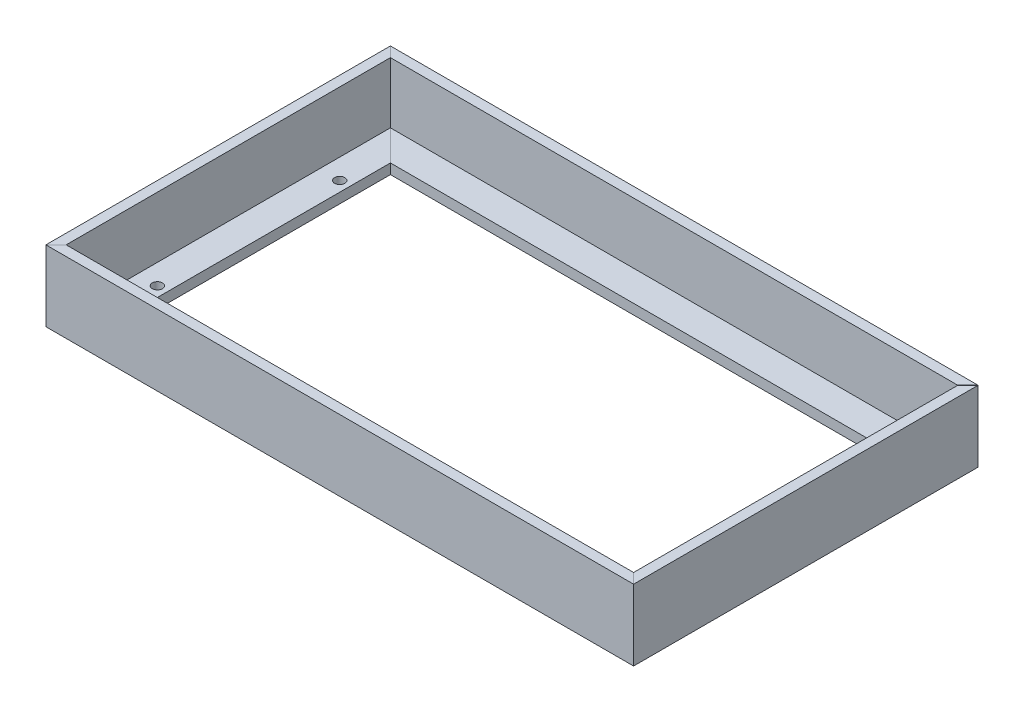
ISO-10303-21;
HEADER;
FILE_DESCRIPTION(('STEP AP214'),'2;1');
FILE_NAME('part.step','',(''),(''),'','','');
FILE_SCHEMA(('AUTOMOTIVE_DESIGN { 1 0 10303 214 1 1 1 1 }'));
ENDSEC;
DATA;
#1=APPLICATION_CONTEXT('core data for automotive mechanical design processes');
#2=APPLICATION_PROTOCOL_DEFINITION('international standard','automotive_design',2000,#1);
#3=PRODUCT_CONTEXT('',#1,'mechanical');
#4=PRODUCT('Part','Part','',(#3));
#5=PRODUCT_RELATED_PRODUCT_CATEGORY('part','',(#4));
#6=PRODUCT_DEFINITION_FORMATION('','',#4);
#7=PRODUCT_DEFINITION_CONTEXT('part definition',#1,'design');
#8=PRODUCT_DEFINITION('design','',#6,#7);
#9=PRODUCT_DEFINITION_SHAPE('','',#8);
#10=(LENGTH_UNIT() NAMED_UNIT(*) SI_UNIT(.MILLI.,.METRE.));
#11=(NAMED_UNIT(*) PLANE_ANGLE_UNIT() SI_UNIT($,.RADIAN.));
#12=(NAMED_UNIT(*) SI_UNIT($,.STERADIAN.) SOLID_ANGLE_UNIT());
#13=UNCERTAINTY_MEASURE_WITH_UNIT(LENGTH_MEASURE(1.E-05),#10,'distance_accuracy_value','');
#14=(GEOMETRIC_REPRESENTATION_CONTEXT(3) GLOBAL_UNCERTAINTY_ASSIGNED_CONTEXT((#13)) GLOBAL_UNIT_ASSIGNED_CONTEXT((#10,
#11,#12)) REPRESENTATION_CONTEXT('',''));
#15=CARTESIAN_POINT('',(0.,0.,0.));
#16=DIRECTION('',(0.,0.,1.));
#17=DIRECTION('',(1.,0.,0.));
#18=AXIS2_PLACEMENT_3D('',#15,#16,#17);
#19=CARTESIAN_POINT('',(171.45,3.17500000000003,53.975));
#20=DIRECTION('',(0.,-1.,0.));
#21=DIRECTION('',(1.,0.,0.));
#22=AXIS2_PLACEMENT_3D('',#19,#20,#21);
#23=PLANE('',#22);
#24=CARTESIAN_POINT('',(9.52500000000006,3.17500000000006,-28.575));
#25=DIRECTION('',(0.,1.,0.));
#26=DIRECTION('',(-1.,0.,0.));
#27=AXIS2_PLACEMENT_3D('',#24,#25,#26);
#28=CIRCLE('',#27,1.5875);
#29=CARTESIAN_POINT('',(7.93750000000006,3.17500000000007,-28.575));
#30=VERTEX_POINT('',#29);
#31=EDGE_CURVE('E175',#30,#30,#28,.T.);
#32=ORIENTED_EDGE('',*,*,#31,.F.);
#33=EDGE_LOOP('',(#32));
#34=FACE_BOUND('',#33,.T.);
#35=CARTESIAN_POINT('',(9.52500000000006,3.17500000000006,28.575));
#36=DIRECTION('',(0.,1.,0.));
#37=DIRECTION('',(-1.,0.,0.));
#38=AXIS2_PLACEMENT_3D('',#35,#36,#37);
#39=CIRCLE('',#38,1.58749999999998);
#40=CARTESIAN_POINT('',(7.93750000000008,3.17500000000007,28.575));
#41=VERTEX_POINT('',#40);
#42=EDGE_CURVE('E145',#41,#41,#39,.T.);
#43=ORIENTED_EDGE('',*,*,#42,.F.);
#44=EDGE_LOOP('',(#43));
#45=FACE_BOUND('',#44,.T.);
#46=DIRECTION('',(0.,0.,-1.));
#47=VECTOR('',#46,1.);
#48=CARTESIAN_POINT('',(3.175,3.175,53.975));
#49=LINE('',#48,#47);
#50=CARTESIAN_POINT('',(3.175,3.175,50.7640789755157));
#51=VERTEX_POINT('',#50);
#52=CARTESIAN_POINT('',(3.17500000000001,3.17500000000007,-50.7640789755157));
#53=VERTEX_POINT('',#52);
#54=EDGE_CURVE('E130',#51,#53,#49,.T.);
#55=ORIENTED_EDGE('',*,*,#54,.F.);
#56=DIRECTION('',(0.707106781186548,0.,-0.707106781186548));
#57=VECTOR('',#56,1.);
#58=CARTESIAN_POINT('',(85.7070394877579,3.17500000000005,-31.7679605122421));
#59=LINE('',#58,#57);
#60=CARTESIAN_POINT('',(12.7,3.17500000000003,41.2390789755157));
#61=VERTEX_POINT('',#60);
#62=EDGE_CURVE('E124',#51,#61,#59,.T.);
#63=ORIENTED_EDGE('',*,*,#62,.T.);
#64=DIRECTION('',(0.,0.,-1.));
#65=VECTOR('',#64,1.);
#66=CARTESIAN_POINT('',(12.7,3.175,53.975));
#67=LINE('',#66,#65);
#68=CARTESIAN_POINT('',(12.7,3.17500000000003,-41.2390789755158));
#69=VERTEX_POINT('',#68);
#70=EDGE_CURVE('E126',#61,#69,#67,.T.);
#71=ORIENTED_EDGE('',*,*,#70,.T.);
#72=DIRECTION('',(-0.707106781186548,0.,-0.707106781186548));
#73=VECTOR('',#72,1.);
#74=CARTESIAN_POINT('',(139.682039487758,3.17500000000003,85.7429605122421));
#75=LINE('',#74,#73);
#76=EDGE_CURVE('E118',#69,#53,#75,.T.);
#77=ORIENTED_EDGE('',*,*,#76,.T.);
#78=EDGE_LOOP('',(#55,#63,#71,#77));
#79=FACE_BOUND('',#78,.T.);
#80=ADVANCED_FACE('F43',(#34,#45,#79),#23,.F.);
#81=CARTESIAN_POINT('',(0.,0.,53.975));
#82=DIRECTION('',(0.,1.,0.));
#83=DIRECTION('',(0.,0.,1.));
#84=AXIS2_PLACEMENT_3D('',#81,#82,#83);
#85=PLANE('',#84);
#86=CARTESIAN_POINT('',(9.52500000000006,0.,-28.575));
#87=DIRECTION('',(0.,1.,0.));
#88=DIRECTION('',(-1.,0.,0.));
#89=AXIS2_PLACEMENT_3D('',#86,#87,#88);
#90=CIRCLE('',#89,1.5875);
#91=CARTESIAN_POINT('',(7.93750000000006,0.,-28.575));
#92=VERTEX_POINT('',#91);
#93=EDGE_CURVE('E127',#92,#92,#90,.T.);
#94=ORIENTED_EDGE('',*,*,#93,.T.);
#95=EDGE_LOOP('',(#94));
#96=FACE_BOUND('',#95,.T.);
#97=CARTESIAN_POINT('',(9.52500000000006,0.,28.575));
#98=DIRECTION('',(0.,1.,0.));
#99=DIRECTION('',(-1.,0.,0.));
#100=AXIS2_PLACEMENT_3D('',#97,#98,#99);
#101=CIRCLE('',#100,1.58749999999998);
#102=CARTESIAN_POINT('',(7.93750000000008,0.,28.575));
#103=VERTEX_POINT('',#102);
#104=EDGE_CURVE('E240',#103,#103,#101,.T.);
#105=ORIENTED_EDGE('',*,*,#104,.T.);
#106=EDGE_LOOP('',(#105));
#107=FACE_BOUND('',#106,.T.);
#108=DIRECTION('',(0.,0.,-1.));
#109=VECTOR('',#108,1.);
#110=CARTESIAN_POINT('',(12.7,0.,53.975));
#111=LINE('',#110,#109);
#112=CARTESIAN_POINT('',(12.7,0.,41.2390789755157));
#113=VERTEX_POINT('',#112);
#114=CARTESIAN_POINT('',(12.7,0.,-41.2390789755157));
#115=VERTEX_POINT('',#114);
#116=EDGE_CURVE('E123',#113,#115,#111,.T.);
#117=ORIENTED_EDGE('',*,*,#116,.F.);
#118=DIRECTION('',(-0.707106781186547,0.,0.707106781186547));
#119=VECTOR('',#118,1.);
#120=CARTESIAN_POINT('',(-0.0179605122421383,0.,53.9570394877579));
#121=LINE('',#120,#119);
#122=CARTESIAN_POINT('',(0.,0.,53.9390789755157));
#123=VERTEX_POINT('',#122);
#124=EDGE_CURVE('E46',#113,#123,#121,.T.);
#125=ORIENTED_EDGE('',*,*,#124,.T.);
#126=DIRECTION('',(0.,0.,-1.));
#127=VECTOR('',#126,1.);
#128=CARTESIAN_POINT('',(0.,0.,53.975));
#129=LINE('',#128,#127);
#130=CARTESIAN_POINT('',(0.,0.,-53.9390789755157));
#131=VERTEX_POINT('',#130);
#132=EDGE_CURVE('E121',#123,#131,#129,.T.);
#133=ORIENTED_EDGE('',*,*,#132,.T.);
#134=DIRECTION('',(0.707106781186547,0.,0.707106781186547));
#135=VECTOR('',#134,1.);
#136=CARTESIAN_POINT('',(-0.0179605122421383,0.,-53.9570394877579));
#137=LINE('',#136,#135);
#138=EDGE_CURVE('E110',#131,#115,#137,.T.);
#139=ORIENTED_EDGE('',*,*,#138,.T.);
#140=EDGE_LOOP('',(#117,#125,#133,#139));
#141=FACE_BOUND('',#140,.T.);
#142=ADVANCED_FACE('F154',(#96,#107,#141),#85,.F.);
#143=CARTESIAN_POINT('',(3.175,22.225,53.975));
#144=DIRECTION('',(0.,-1.,0.));
#145=DIRECTION('',(0.,0.,-1.));
#146=AXIS2_PLACEMENT_3D('',#143,#144,#145);
#147=PLANE('',#146);
#148=DIRECTION('',(0.,0.,-1.));
#149=VECTOR('',#148,1.);
#150=CARTESIAN_POINT('',(0.,22.225,53.975));
#151=LINE('',#150,#149);
#152=CARTESIAN_POINT('',(0.,22.225,53.9390789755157));
#153=VERTEX_POINT('',#152);
#154=CARTESIAN_POINT('',(0.,22.225,-53.9390789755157));
#155=VERTEX_POINT('',#154);
#156=EDGE_CURVE('E94',#153,#155,#151,.T.);
#157=ORIENTED_EDGE('',*,*,#156,.F.);
#158=DIRECTION('',(-0.707106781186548,0.,0.707106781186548));
#159=VECTOR('',#158,1.);
#160=CARTESIAN_POINT('',(12.6820394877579,22.225,41.2570394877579));
#161=LINE('',#160,#159);
#162=CARTESIAN_POINT('',(3.175,22.225,50.7640789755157));
#163=VERTEX_POINT('',#162);
#164=EDGE_CURVE('E12',#163,#153,#161,.T.);
#165=ORIENTED_EDGE('',*,*,#164,.F.);
#166=DIRECTION('',(0.,0.,-1.));
#167=VECTOR('',#166,1.);
#168=CARTESIAN_POINT('',(3.175,22.225,53.975));
#169=LINE('',#168,#167);
#170=CARTESIAN_POINT('',(3.17500000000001,22.225,-50.7640789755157));
#171=VERTEX_POINT('',#170);
#172=EDGE_CURVE('E114',#163,#171,#169,.T.);
#173=ORIENTED_EDGE('',*,*,#172,.T.);
#174=DIRECTION('',(0.707106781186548,0.,0.707106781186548));
#175=VECTOR('',#174,1.);
#176=CARTESIAN_POINT('',(12.6820394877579,22.225,-41.2570394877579));
#177=LINE('',#176,#175);
#178=EDGE_CURVE('E52',#155,#171,#177,.T.);
#179=ORIENTED_EDGE('',*,*,#178,.F.);
#180=EDGE_LOOP('',(#157,#165,#173,#179));
#181=FACE_BOUND('',#180,.T.);
#182=ADVANCED_FACE('F112',(#181),#147,.F.);
#183=CARTESIAN_POINT('',(12.7,0.,53.975));
#184=DIRECTION('',(-1.,0.,0.));
#185=DIRECTION('',(0.,0.,1.));
#186=AXIS2_PLACEMENT_3D('',#183,#184,#185);
#187=PLANE('',#186);
#188=ORIENTED_EDGE('',*,*,#70,.F.);
#189=DIRECTION('',(0.,-1.,0.));
#190=VECTOR('',#189,1.);
#191=CARTESIAN_POINT('',(12.7,0.,41.2390789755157));
#192=LINE('',#191,#190);
#193=EDGE_CURVE('E59',#61,#113,#192,.T.);
#194=ORIENTED_EDGE('',*,*,#193,.T.);
#195=ORIENTED_EDGE('',*,*,#116,.T.);
#196=DIRECTION('',(0.,1.,0.));
#197=VECTOR('',#196,1.);
#198=CARTESIAN_POINT('',(12.7,0.,-41.2390789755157));
#199=LINE('',#198,#197);
#200=EDGE_CURVE('E131',#115,#69,#199,.T.);
#201=ORIENTED_EDGE('',*,*,#200,.T.);
#202=EDGE_LOOP('',(#188,#194,#195,#201));
#203=FACE_BOUND('',#202,.T.);
#204=ADVANCED_FACE('F155',(#203),#187,.F.);
#205=CARTESIAN_POINT('',(3.175,3.175,53.975));
#206=DIRECTION('',(-1.,0.,0.));
#207=DIRECTION('',(0.,-1.,0.));
#208=AXIS2_PLACEMENT_3D('',#205,#206,#207);
#209=PLANE('',#208);
#210=ORIENTED_EDGE('',*,*,#172,.F.);
#211=DIRECTION('',(0.,-1.,0.));
#212=VECTOR('',#211,1.);
#213=CARTESIAN_POINT('',(3.175,3.175,50.7640789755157));
#214=LINE('',#213,#212);
#215=EDGE_CURVE('E128',#163,#51,#214,.T.);
#216=ORIENTED_EDGE('',*,*,#215,.T.);
#217=ORIENTED_EDGE('',*,*,#54,.T.);
#218=DIRECTION('',(0.,1.,0.));
#219=VECTOR('',#218,1.);
#220=CARTESIAN_POINT('',(3.175,3.17499999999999,-50.7640789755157));
#221=LINE('',#220,#219);
#222=EDGE_CURVE('E134',#53,#171,#221,.T.);
#223=ORIENTED_EDGE('',*,*,#222,.T.);
#224=EDGE_LOOP('',(#210,#216,#217,#223));
#225=FACE_BOUND('',#224,.T.);
#226=ADVANCED_FACE('F157',(#225),#209,.F.);
#227=CARTESIAN_POINT('',(0.,0.,53.975));
#228=DIRECTION('',(1.,0.,0.));
#229=DIRECTION('',(0.,0.,-1.));
#230=AXIS2_PLACEMENT_3D('',#227,#228,#229);
#231=PLANE('',#230);
#232=ORIENTED_EDGE('',*,*,#132,.F.);
#233=DIRECTION('',(0.,1.,0.));
#234=VECTOR('',#233,1.);
#235=CARTESIAN_POINT('',(0.,0.,53.9390789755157));
#236=LINE('',#235,#234);
#237=EDGE_CURVE('E74',#123,#153,#236,.T.);
#238=ORIENTED_EDGE('',*,*,#237,.T.);
#239=ORIENTED_EDGE('',*,*,#156,.T.);
#240=DIRECTION('',(0.,-1.,0.));
#241=VECTOR('',#240,1.);
#242=CARTESIAN_POINT('',(0.,0.,-53.9390789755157));
#243=LINE('',#242,#241);
#244=EDGE_CURVE('E98',#155,#131,#243,.T.);
#245=ORIENTED_EDGE('',*,*,#244,.T.);
#246=EDGE_LOOP('',(#232,#238,#239,#245));
#247=FACE_BOUND('',#246,.T.);
#248=ADVANCED_FACE('F97',(#247),#231,.F.);
#249=CARTESIAN_POINT('',(12.6820394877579,0.,-41.2570394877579));
#250=DIRECTION('',(-0.707106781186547,0.,0.707106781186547));
#251=DIRECTION('',(0.707106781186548,0.,0.707106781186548));
#252=AXIS2_PLACEMENT_3D('',#249,#250,#251);
#253=PLANE('',#252);
#254=ORIENTED_EDGE('',*,*,#138,.F.);
#255=ORIENTED_EDGE('',*,*,#244,.F.);
#256=ORIENTED_EDGE('',*,*,#178,.T.);
#257=ORIENTED_EDGE('',*,*,#222,.F.);
#258=ORIENTED_EDGE('',*,*,#76,.F.);
#259=ORIENTED_EDGE('',*,*,#200,.F.);
#260=EDGE_LOOP('',(#254,#255,#256,#257,#258,#259));
#261=FACE_BOUND('',#260,.T.);
#262=ADVANCED_FACE('F105',(#261),#253,.F.);
#263=CARTESIAN_POINT('',(12.6820394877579,0.,41.2570394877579));
#264=DIRECTION('',(-0.707106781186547,0.,-0.707106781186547));
#265=DIRECTION('',(-0.707106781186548,0.,0.707106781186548));
#266=AXIS2_PLACEMENT_3D('',#263,#264,#265);
#267=PLANE('',#266);
#268=ORIENTED_EDGE('',*,*,#62,.F.);
#269=ORIENTED_EDGE('',*,*,#215,.F.);
#270=ORIENTED_EDGE('',*,*,#164,.T.);
#271=ORIENTED_EDGE('',*,*,#237,.F.);
#272=ORIENTED_EDGE('',*,*,#124,.F.);
#273=ORIENTED_EDGE('',*,*,#193,.F.);
#274=EDGE_LOOP('',(#268,#269,#270,#271,#272,#273));
#275=FACE_BOUND('',#274,.T.);
#276=ADVANCED_FACE('F178',(#275),#267,.F.);
#277=CARTESIAN_POINT('',(9.52500000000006,0.,28.575));
#278=DIRECTION('',(0.,1.,0.));
#279=DIRECTION('',(-1.,0.,0.));
#280=AXIS2_PLACEMENT_3D('',#277,#278,#279);
#281=CYLINDRICAL_SURFACE('',#280,1.58749999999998);
#282=ORIENTED_EDGE('',*,*,#104,.F.);
#283=EDGE_LOOP('',(#282));
#284=FACE_BOUND('',#283,.T.);
#285=ORIENTED_EDGE('',*,*,#42,.T.);
#286=EDGE_LOOP('',(#285));
#287=FACE_BOUND('',#286,.T.);
#288=ADVANCED_FACE('F180',(#284,#287),#281,.F.);
#289=CARTESIAN_POINT('',(9.52500000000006,0.,-28.575));
#290=DIRECTION('',(0.,1.,0.));
#291=DIRECTION('',(-1.,0.,0.));
#292=AXIS2_PLACEMENT_3D('',#289,#290,#291);
#293=CYLINDRICAL_SURFACE('',#292,1.5875);
#294=ORIENTED_EDGE('',*,*,#93,.F.);
#295=EDGE_LOOP('',(#294));
#296=FACE_BOUND('',#295,.T.);
#297=ORIENTED_EDGE('',*,*,#31,.T.);
#298=EDGE_LOOP('',(#297));
#299=FACE_BOUND('',#298,.T.);
#300=ADVANCED_FACE('F186',(#296,#299),#293,.F.);
#301=CLOSED_SHELL('',(#80,#142,#182,#204,#226,#248,#262,#276,#288,#300));
#302=MANIFOLD_SOLID_BREP('B2',#301);
#303=CARTESIAN_POINT('',(184.132039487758,0.,53.9929605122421));
#304=DIRECTION('',(-0.707106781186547,0.,0.707106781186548));
#305=DIRECTION('',(0.707106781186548,0.,0.707106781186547));
#306=AXIS2_PLACEMENT_3D('',#303,#304,#305);
#307=PLANE('',#306);
#308=DIRECTION('',(0.,-1.,0.));
#309=VECTOR('',#308,1.);
#310=CARTESIAN_POINT('',(184.114078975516,0.,53.975));
#311=LINE('',#310,#309);
#312=CARTESIAN_POINT('',(184.114078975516,22.225,53.975));
#313=VERTEX_POINT('',#312);
#314=CARTESIAN_POINT('',(184.114078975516,0.,53.975));
#315=VERTEX_POINT('',#314);
#316=EDGE_CURVE('E369',#313,#315,#311,.T.);
#317=ORIENTED_EDGE('',*,*,#316,.T.);
#318=DIRECTION('',(0.707106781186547,0.,0.707106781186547));
#319=VECTOR('',#318,1.);
#320=CARTESIAN_POINT('',(171.432039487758,0.,41.2929605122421));
#321=LINE('',#320,#319);
#322=CARTESIAN_POINT('',(171.414078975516,0.,41.275));
#323=VERTEX_POINT('',#322);
#324=EDGE_CURVE('E364',#323,#315,#321,.T.);
#325=ORIENTED_EDGE('',*,*,#324,.F.);
#326=DIRECTION('',(0.,1.,0.));
#327=VECTOR('',#326,1.);
#328=CARTESIAN_POINT('',(171.414078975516,0.,41.275));
#329=LINE('',#328,#327);
#330=CARTESIAN_POINT('',(171.414078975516,3.17500000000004,41.275));
#331=VERTEX_POINT('',#330);
#332=EDGE_CURVE('E362',#323,#331,#329,.T.);
#333=ORIENTED_EDGE('',*,*,#332,.T.);
#334=DIRECTION('',(-0.707106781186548,0.,-0.707106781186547));
#335=VECTOR('',#334,1.);
#336=CARTESIAN_POINT('',(177.782039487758,3.17500000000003,47.6429605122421));
#337=LINE('',#336,#335);
#338=CARTESIAN_POINT('',(180.939078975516,3.17500000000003,50.8));
#339=VERTEX_POINT('',#338);
#340=EDGE_CURVE('E359',#339,#331,#337,.T.);
#341=ORIENTED_EDGE('',*,*,#340,.F.);
#342=DIRECTION('',(0.,-1.,0.));
#343=VECTOR('',#342,1.);
#344=CARTESIAN_POINT('',(180.939078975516,0.,50.8));
#345=LINE('',#344,#343);
#346=CARTESIAN_POINT('',(180.939078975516,22.225,50.8));
#347=VERTEX_POINT('',#346);
#348=EDGE_CURVE('E387',#347,#339,#345,.T.);
#349=ORIENTED_EDGE('',*,*,#348,.F.);
#350=DIRECTION('',(0.707106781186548,0.,0.707106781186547));
#351=VECTOR('',#350,1.);
#352=CARTESIAN_POINT('',(184.132039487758,22.225,53.9929605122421));
#353=LINE('',#352,#351);
#354=EDGE_CURVE('E317',#347,#313,#353,.T.);
#355=ORIENTED_EDGE('',*,*,#354,.T.);
#356=EDGE_LOOP('',(#317,#325,#333,#341,#349,#355));
#357=FACE_BOUND('',#356,.T.);
#358=ADVANCED_FACE('F309',(#357),#307,.F.);
#359=CARTESIAN_POINT('',(12.7,0.,41.275));
#360=DIRECTION('',(0.,0.,-1.));
#361=DIRECTION('',(-1.,0.,0.));
#362=AXIS2_PLACEMENT_3D('',#359,#360,#361);
#363=PLANE('',#362);
#364=DIRECTION('',(0.,-1.,0.));
#365=VECTOR('',#364,1.);
#366=CARTESIAN_POINT('',(12.7359210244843,0.,41.275));
#367=LINE('',#366,#365);
#368=CARTESIAN_POINT('',(12.7359210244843,3.175,41.275));
#369=VERTEX_POINT('',#368);
#370=CARTESIAN_POINT('',(12.7359210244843,0.,41.275));
#371=VERTEX_POINT('',#370);
#372=EDGE_CURVE('E41',#369,#371,#367,.T.);
#373=ORIENTED_EDGE('',*,*,#372,.F.);
#374=DIRECTION('',(-1.,0.,0.));
#375=VECTOR('',#374,1.);
#376=CARTESIAN_POINT('',(12.7,3.175,41.275));
#377=LINE('',#376,#375);
#378=EDGE_CURVE('E374',#331,#369,#377,.T.);
#379=ORIENTED_EDGE('',*,*,#378,.F.);
#380=ORIENTED_EDGE('',*,*,#332,.F.);
#381=DIRECTION('',(-1.,0.,0.));
#382=VECTOR('',#381,1.);
#383=CARTESIAN_POINT('',(12.7,0.,41.275));
#384=LINE('',#383,#382);
#385=EDGE_CURVE('E384',#323,#371,#384,.T.);
#386=ORIENTED_EDGE('',*,*,#385,.T.);
#387=EDGE_LOOP('',(#373,#379,#380,#386));
#388=FACE_BOUND('',#387,.T.);
#389=ADVANCED_FACE('F379',(#388),#363,.T.);
#390=CARTESIAN_POINT('',(0.,0.,53.975));
#391=DIRECTION('',(0.,0.,1.));
#392=DIRECTION('',(1.,0.,0.));
#393=AXIS2_PLACEMENT_3D('',#390,#391,#392);
#394=PLANE('',#393);
#395=DIRECTION('',(0.,1.,0.));
#396=VECTOR('',#395,1.);
#397=CARTESIAN_POINT('',(0.0359210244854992,0.,53.975));
#398=LINE('',#397,#396);
#399=CARTESIAN_POINT('',(0.0359210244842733,0.,53.975));
#400=VERTEX_POINT('',#399);
#401=CARTESIAN_POINT('',(0.0359210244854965,22.225,53.975));
#402=VERTEX_POINT('',#401);
#403=EDGE_CURVE('E377',#400,#402,#398,.T.);
#404=ORIENTED_EDGE('',*,*,#403,.F.);
#405=DIRECTION('',(1.,0.,0.));
#406=VECTOR('',#405,1.);
#407=CARTESIAN_POINT('',(0.,0.,53.975));
#408=LINE('',#407,#406);
#409=EDGE_CURVE('E345',#400,#315,#408,.T.);
#410=ORIENTED_EDGE('',*,*,#409,.T.);
#411=ORIENTED_EDGE('',*,*,#316,.F.);
#412=DIRECTION('',(-1.,0.,0.));
#413=VECTOR('',#412,1.);
#414=CARTESIAN_POINT('',(3.175,22.225,53.975));
#415=LINE('',#414,#413);
#416=EDGE_CURVE('E389',#313,#402,#415,.T.);
#417=ORIENTED_EDGE('',*,*,#416,.T.);
#418=EDGE_LOOP('',(#404,#410,#411,#417));
#419=FACE_BOUND('',#418,.T.);
#420=ADVANCED_FACE('F403',(#419),#394,.T.);
#421=CARTESIAN_POINT('',(0.,0.,50.8));
#422=DIRECTION('',(0.,0.,1.));
#423=DIRECTION('',(1.,0.,0.));
#424=AXIS2_PLACEMENT_3D('',#421,#422,#423);
#425=PLANE('',#424);
#426=DIRECTION('',(-1.,0.,0.));
#427=VECTOR('',#426,1.);
#428=CARTESIAN_POINT('',(12.7,3.175,50.8));
#429=LINE('',#428,#427);
#430=CARTESIAN_POINT('',(3.21092102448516,3.17500000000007,50.8));
#431=VERTEX_POINT('',#430);
#432=EDGE_CURVE('E376',#339,#431,#429,.T.);
#433=ORIENTED_EDGE('',*,*,#432,.T.);
#434=DIRECTION('',(0.,1.,0.));
#435=VECTOR('',#434,1.);
#436=CARTESIAN_POINT('',(3.21092102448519,0.,50.8));
#437=LINE('',#436,#435);
#438=CARTESIAN_POINT('',(3.21092102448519,22.225,50.8));
#439=VERTEX_POINT('',#438);
#440=EDGE_CURVE('E352',#431,#439,#437,.T.);
#441=ORIENTED_EDGE('',*,*,#440,.T.);
#442=DIRECTION('',(-1.,0.,0.));
#443=VECTOR('',#442,1.);
#444=CARTESIAN_POINT('',(0.,22.225,50.8));
#445=LINE('',#444,#443);
#446=EDGE_CURVE('E381',#347,#439,#445,.T.);
#447=ORIENTED_EDGE('',*,*,#446,.F.);
#448=ORIENTED_EDGE('',*,*,#348,.T.);
#449=EDGE_LOOP('',(#433,#441,#447,#448));
#450=FACE_BOUND('',#449,.T.);
#451=ADVANCED_FACE('F397',(#450),#425,.F.);
#452=CARTESIAN_POINT('',(3.175,22.225,53.975));
#453=DIRECTION('',(0.,-1.,0.));
#454=DIRECTION('',(0.,0.,-1.));
#455=AXIS2_PLACEMENT_3D('',#452,#453,#454);
#456=PLANE('',#455);
#457=ORIENTED_EDGE('',*,*,#446,.T.);
#458=DIRECTION('',(0.707106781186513,0.,-0.707106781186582));
#459=VECTOR('',#458,1.);
#460=CARTESIAN_POINT('',(12.7179605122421,22.225,41.2929605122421));
#461=LINE('',#460,#459);
#462=EDGE_CURVE('E402',#402,#439,#461,.T.);
#463=ORIENTED_EDGE('',*,*,#462,.F.);
#464=ORIENTED_EDGE('',*,*,#416,.F.);
#465=ORIENTED_EDGE('',*,*,#354,.F.);
#466=EDGE_LOOP('',(#457,#463,#464,#465));
#467=FACE_BOUND('',#466,.T.);
#468=ADVANCED_FACE('F400',(#467),#456,.F.);
#469=CARTESIAN_POINT('',(0.,0.,53.975));
#470=DIRECTION('',(0.,1.,0.));
#471=DIRECTION('',(0.,0.,1.));
#472=AXIS2_PLACEMENT_3D('',#469,#470,#471);
#473=PLANE('',#472);
#474=ORIENTED_EDGE('',*,*,#409,.F.);
#475=DIRECTION('',(0.707106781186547,0.,-0.707106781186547));
#476=VECTOR('',#475,1.);
#477=CARTESIAN_POINT('',(0.0179605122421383,0.,53.9929605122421));
#478=LINE('',#477,#476);
#479=EDGE_CURVE('E411',#400,#371,#478,.T.);
#480=ORIENTED_EDGE('',*,*,#479,.T.);
#481=ORIENTED_EDGE('',*,*,#385,.F.);
#482=ORIENTED_EDGE('',*,*,#324,.T.);
#483=EDGE_LOOP('',(#474,#480,#481,#482));
#484=FACE_BOUND('',#483,.T.);
#485=ADVANCED_FACE('F419',(#484),#473,.F.);
#486=CARTESIAN_POINT('',(171.45,3.17500000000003,53.975));
#487=DIRECTION('',(0.,-1.,0.));
#488=DIRECTION('',(1.,0.,0.));
#489=AXIS2_PLACEMENT_3D('',#486,#487,#488);
#490=PLANE('',#489);
#491=ORIENTED_EDGE('',*,*,#378,.T.);
#492=DIRECTION('',(-0.707106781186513,0.,0.707106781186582));
#493=VECTOR('',#492,1.);
#494=CARTESIAN_POINT('',(85.7429605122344,3.17500000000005,-31.7320394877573));
#495=LINE('',#494,#493);
#496=EDGE_CURVE('E323',#369,#431,#495,.T.);
#497=ORIENTED_EDGE('',*,*,#496,.T.);
#498=ORIENTED_EDGE('',*,*,#432,.F.);
#499=ORIENTED_EDGE('',*,*,#340,.T.);
#500=EDGE_LOOP('',(#491,#497,#498,#499));
#501=FACE_BOUND('',#500,.T.);
#502=ADVANCED_FACE('F311',(#501),#490,.F.);
#503=CARTESIAN_POINT('',(12.7179605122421,0.,41.2929605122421));
#504=DIRECTION('',(0.707106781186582,0.,0.707106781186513));
#505=DIRECTION('',(0.707106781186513,0.,-0.707106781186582));
#506=AXIS2_PLACEMENT_3D('',#503,#504,#505);
#507=PLANE('',#506);
#508=ORIENTED_EDGE('',*,*,#403,.T.);
#509=ORIENTED_EDGE('',*,*,#462,.T.);
#510=ORIENTED_EDGE('',*,*,#440,.F.);
#511=ORIENTED_EDGE('',*,*,#496,.F.);
#512=ORIENTED_EDGE('',*,*,#372,.T.);
#513=ORIENTED_EDGE('',*,*,#479,.F.);
#514=EDGE_LOOP('',(#508,#509,#510,#511,#512,#513));
#515=FACE_BOUND('',#514,.T.);
#516=ADVANCED_FACE('F412',(#515),#507,.F.);
#517=CLOSED_SHELL('',(#358,#389,#420,#451,#468,#485,#502,#516));
#518=MANIFOLD_SOLID_BREP('B6',#517);
#519=CARTESIAN_POINT('',(171.467960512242,0.,-41.2570394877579));
#520=DIRECTION('',(0.707106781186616,0.,0.707106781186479));
#521=DIRECTION('',(0.707106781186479,0.,-0.707106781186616));
#522=AXIS2_PLACEMENT_3D('',#519,#520,#521);
#523=PLANE('',#522);
#524=DIRECTION('',(0.707106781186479,0.,-0.707106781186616));
#525=VECTOR('',#524,1.);
#526=CARTESIAN_POINT('',(171.467960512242,22.225,-41.2570394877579));
#527=LINE('',#526,#525);
#528=CARTESIAN_POINT('',(180.975,22.225,-50.7640789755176));
#529=VERTEX_POINT('',#528);
#530=CARTESIAN_POINT('',(184.15,22.225,-53.9390789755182));
#531=VERTEX_POINT('',#530);
#532=EDGE_CURVE('E607',#529,#531,#527,.T.);
#533=ORIENTED_EDGE('',*,*,#532,.T.);
#534=DIRECTION('',(0.,-1.,0.));
#535=VECTOR('',#534,1.);
#536=CARTESIAN_POINT('',(184.15,22.225,-53.9390789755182));
#537=LINE('',#536,#535);
#538=CARTESIAN_POINT('',(184.15,0.,-53.9390789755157));
#539=VERTEX_POINT('',#538);
#540=EDGE_CURVE('E543',#531,#539,#537,.T.);
#541=ORIENTED_EDGE('',*,*,#540,.T.);
#542=DIRECTION('',(0.707106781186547,0.,-0.707106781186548));
#543=VECTOR('',#542,1.);
#544=CARTESIAN_POINT('',(184.167960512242,0.,-53.9570394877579));
#545=LINE('',#544,#543);
#546=CARTESIAN_POINT('',(171.45,0.,-41.2390789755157));
#547=VERTEX_POINT('',#546);
#548=EDGE_CURVE('E595',#547,#539,#545,.T.);
#549=ORIENTED_EDGE('',*,*,#548,.F.);
#550=DIRECTION('',(0.,-1.,0.));
#551=VECTOR('',#550,1.);
#552=CARTESIAN_POINT('',(171.45,0.,-41.2390789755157));
#553=LINE('',#552,#551);
#554=CARTESIAN_POINT('',(171.45,3.17500000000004,-41.2390789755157));
#555=VERTEX_POINT('',#554);
#556=EDGE_CURVE('E583',#555,#547,#553,.T.);
#557=ORIENTED_EDGE('',*,*,#556,.F.);
#558=DIRECTION('',(-0.707106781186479,0.,0.707106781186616));
#559=VECTOR('',#558,1.);
#560=CARTESIAN_POINT('',(123.842960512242,3.17500000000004,6.36796051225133));
#561=LINE('',#560,#559);
#562=CARTESIAN_POINT('',(180.975,3.17500000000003,-50.7640789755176));
#563=VERTEX_POINT('',#562);
#564=EDGE_CURVE('E594',#563,#555,#561,.T.);
#565=ORIENTED_EDGE('',*,*,#564,.F.);
#566=DIRECTION('',(0.,-1.,0.));
#567=VECTOR('',#566,1.);
#568=CARTESIAN_POINT('',(180.975,3.17500000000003,-50.7640789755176));
#569=LINE('',#568,#567);
#570=EDGE_CURVE('E589',#529,#563,#569,.T.);
#571=ORIENTED_EDGE('',*,*,#570,.F.);
#572=EDGE_LOOP('',(#533,#541,#549,#557,#565,#571));
#573=FACE_BOUND('',#572,.T.);
#574=ADVANCED_FACE('F535',(#573),#523,.F.);
#575=CARTESIAN_POINT('',(171.45,0.,53.975));
#576=DIRECTION('',(1.,0.,0.));
#577=DIRECTION('',(0.,0.,-1.));
#578=AXIS2_PLACEMENT_3D('',#575,#576,#577);
#579=PLANE('',#578);
#580=DIRECTION('',(0.,0.,-1.));
#581=VECTOR('',#580,1.);
#582=CARTESIAN_POINT('',(171.45,0.,53.975));
#583=LINE('',#582,#581);
#584=CARTESIAN_POINT('',(171.45,0.,41.2390789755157));
#585=VERTEX_POINT('',#584);
#586=EDGE_CURVE('E573',#585,#547,#583,.T.);
#587=ORIENTED_EDGE('',*,*,#586,.F.);
#588=DIRECTION('',(0.,1.,0.));
#589=VECTOR('',#588,1.);
#590=CARTESIAN_POINT('',(171.45,0.,41.2390789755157));
#591=LINE('',#590,#589);
#592=CARTESIAN_POINT('',(171.45,3.17500000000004,41.2390789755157));
#593=VERTEX_POINT('',#592);
#594=EDGE_CURVE('E585',#585,#593,#591,.T.);
#595=ORIENTED_EDGE('',*,*,#594,.T.);
#596=DIRECTION('',(0.,0.,-1.));
#597=VECTOR('',#596,1.);
#598=CARTESIAN_POINT('',(171.45,3.17500000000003,53.975));
#599=LINE('',#598,#597);
#600=EDGE_CURVE('E580',#593,#555,#599,.T.);
#601=ORIENTED_EDGE('',*,*,#600,.T.);
#602=ORIENTED_EDGE('',*,*,#556,.T.);
#603=EDGE_LOOP('',(#587,#595,#601,#602));
#604=FACE_BOUND('',#603,.T.);
#605=ADVANCED_FACE('F582',(#604),#579,.F.);
#606=CARTESIAN_POINT('',(184.15,22.225,50.8));
#607=DIRECTION('',(1.,0.,0.));
#608=DIRECTION('',(0.,0.,-1.));
#609=AXIS2_PLACEMENT_3D('',#606,#607,#608);
#610=PLANE('',#609);
#611=DIRECTION('',(0.,1.,0.));
#612=VECTOR('',#611,1.);
#613=CARTESIAN_POINT('',(184.15,22.225,53.9390789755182));
#614=LINE('',#613,#612);
#615=CARTESIAN_POINT('',(184.15,0.,53.9390789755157));
#616=VERTEX_POINT('',#615);
#617=CARTESIAN_POINT('',(184.15,22.225,53.9390789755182));
#618=VERTEX_POINT('',#617);
#619=EDGE_CURVE('E307',#616,#618,#614,.T.);
#620=ORIENTED_EDGE('',*,*,#619,.F.);
#621=DIRECTION('',(0.,0.,1.));
#622=VECTOR('',#621,1.);
#623=CARTESIAN_POINT('',(184.15,0.,50.8));
#624=LINE('',#623,#622);
#625=EDGE_CURVE('E608',#539,#616,#624,.T.);
#626=ORIENTED_EDGE('',*,*,#625,.F.);
#627=ORIENTED_EDGE('',*,*,#540,.F.);
#628=DIRECTION('',(0.,0.,1.));
#629=VECTOR('',#628,1.);
#630=CARTESIAN_POINT('',(184.15,22.225,50.8));
#631=LINE('',#630,#629);
#632=EDGE_CURVE('E596',#531,#618,#631,.T.);
#633=ORIENTED_EDGE('',*,*,#632,.T.);
#634=EDGE_LOOP('',(#620,#626,#627,#633));
#635=FACE_BOUND('',#634,.T.);
#636=ADVANCED_FACE('F620',(#635),#610,.T.);
#637=CARTESIAN_POINT('',(180.975,3.17500000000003,53.975));
#638=DIRECTION('',(1.,0.,0.));
#639=DIRECTION('',(0.,0.,-1.));
#640=AXIS2_PLACEMENT_3D('',#637,#638,#639);
#641=PLANE('',#640);
#642=DIRECTION('',(0.,0.,-1.));
#643=VECTOR('',#642,1.);
#644=CARTESIAN_POINT('',(180.975,3.17500000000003,53.975));
#645=LINE('',#644,#643);
#646=CARTESIAN_POINT('',(180.975,3.17500000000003,50.7640789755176));
#647=VERTEX_POINT('',#646);
#648=EDGE_CURVE('E599',#647,#563,#645,.T.);
#649=ORIENTED_EDGE('',*,*,#648,.F.);
#650=DIRECTION('',(0.,1.,0.));
#651=VECTOR('',#650,1.);
#652=CARTESIAN_POINT('',(180.975,3.17500000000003,50.7640789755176));
#653=LINE('',#652,#651);
#654=CARTESIAN_POINT('',(180.975,22.225,50.7640789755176));
#655=VERTEX_POINT('',#654);
#656=EDGE_CURVE('E602',#647,#655,#653,.T.);
#657=ORIENTED_EDGE('',*,*,#656,.T.);
#658=DIRECTION('',(0.,0.,-1.));
#659=VECTOR('',#658,1.);
#660=CARTESIAN_POINT('',(180.975,22.225,53.975));
#661=LINE('',#660,#659);
#662=EDGE_CURVE('E558',#655,#529,#661,.T.);
#663=ORIENTED_EDGE('',*,*,#662,.T.);
#664=ORIENTED_EDGE('',*,*,#570,.T.);
#665=EDGE_LOOP('',(#649,#657,#663,#664));
#666=FACE_BOUND('',#665,.T.);
#667=ADVANCED_FACE('F649',(#666),#641,.F.);
#668=CARTESIAN_POINT('',(3.175,22.225,53.975));
#669=DIRECTION('',(0.,-1.,0.));
#670=DIRECTION('',(0.,0.,-1.));
#671=AXIS2_PLACEMENT_3D('',#668,#669,#670);
#672=PLANE('',#671);
#673=ORIENTED_EDGE('',*,*,#662,.F.);
#674=DIRECTION('',(-0.707106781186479,0.,-0.707106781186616));
#675=VECTOR('',#674,1.);
#676=CARTESIAN_POINT('',(171.467960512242,22.225,41.2570394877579));
#677=LINE('',#676,#675);
#678=EDGE_CURVE('E629',#618,#655,#677,.T.);
#679=ORIENTED_EDGE('',*,*,#678,.F.);
#680=ORIENTED_EDGE('',*,*,#632,.F.);
#681=ORIENTED_EDGE('',*,*,#532,.F.);
#682=EDGE_LOOP('',(#673,#679,#680,#681));
#683=FACE_BOUND('',#682,.T.);
#684=ADVANCED_FACE('F627',(#683),#672,.F.);
#685=CARTESIAN_POINT('',(0.,0.,53.975));
#686=DIRECTION('',(0.,1.,0.));
#687=DIRECTION('',(0.,0.,1.));
#688=AXIS2_PLACEMENT_3D('',#685,#686,#687);
#689=PLANE('',#688);
#690=CARTESIAN_POINT('',(174.625,0.,-28.575));
#691=DIRECTION('',(0.,1.,0.));
#692=DIRECTION('',(-1.,0.,0.));
#693=AXIS2_PLACEMENT_3D('',#690,#691,#692);
#694=CIRCLE('',#693,1.58749999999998);
#695=CARTESIAN_POINT('',(173.0375,0.,-28.575));
#696=VERTEX_POINT('',#695);
#697=EDGE_CURVE('E643',#696,#696,#694,.T.);
#698=ORIENTED_EDGE('',*,*,#697,.T.);
#699=EDGE_LOOP('',(#698));
#700=FACE_BOUND('',#699,.T.);
#701=CARTESIAN_POINT('',(174.625,0.,28.575));
#702=DIRECTION('',(0.,1.,0.));
#703=DIRECTION('',(-1.,0.,0.));
#704=AXIS2_PLACEMENT_3D('',#701,#702,#703);
#705=CIRCLE('',#704,1.58749999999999);
#706=CARTESIAN_POINT('',(173.0375,0.,28.575));
#707=VERTEX_POINT('',#706);
#708=EDGE_CURVE('E675',#707,#707,#705,.T.);
#709=ORIENTED_EDGE('',*,*,#708,.T.);
#710=EDGE_LOOP('',(#709));
#711=FACE_BOUND('',#710,.T.);
#712=ORIENTED_EDGE('',*,*,#625,.T.);
#713=DIRECTION('',(-0.707106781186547,0.,-0.707106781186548));
#714=VECTOR('',#713,1.);
#715=CARTESIAN_POINT('',(184.167960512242,0.,53.9570394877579));
#716=LINE('',#715,#714);
#717=EDGE_CURVE('E549',#616,#585,#716,.T.);
#718=ORIENTED_EDGE('',*,*,#717,.T.);
#719=ORIENTED_EDGE('',*,*,#586,.T.);
#720=ORIENTED_EDGE('',*,*,#548,.T.);
#721=EDGE_LOOP('',(#712,#718,#719,#720));
#722=FACE_BOUND('',#721,.T.);
#723=ADVANCED_FACE('F641',(#700,#711,#722),#689,.F.);
#724=CARTESIAN_POINT('',(171.45,3.17500000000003,53.975));
#725=DIRECTION('',(0.,-1.,0.));
#726=DIRECTION('',(1.,0.,0.));
#727=AXIS2_PLACEMENT_3D('',#724,#725,#726);
#728=PLANE('',#727);
#729=CARTESIAN_POINT('',(174.625,3.17500000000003,-28.575));
#730=DIRECTION('',(0.,1.,0.));
#731=DIRECTION('',(-1.,0.,0.));
#732=AXIS2_PLACEMENT_3D('',#729,#730,#731);
#733=CIRCLE('',#732,1.58749999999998);
#734=CARTESIAN_POINT('',(173.0375,3.17500000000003,-28.575));
#735=VERTEX_POINT('',#734);
#736=EDGE_CURVE('E677',#735,#735,#733,.T.);
#737=ORIENTED_EDGE('',*,*,#736,.F.);
#738=EDGE_LOOP('',(#737));
#739=FACE_BOUND('',#738,.T.);
#740=CARTESIAN_POINT('',(174.625,3.17500000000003,28.575));
#741=DIRECTION('',(0.,1.,0.));
#742=DIRECTION('',(-1.,0.,0.));
#743=AXIS2_PLACEMENT_3D('',#740,#741,#742);
#744=CIRCLE('',#743,1.58749999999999);
#745=CARTESIAN_POINT('',(173.0375,3.17500000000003,28.575));
#746=VERTEX_POINT('',#745);
#747=EDGE_CURVE('E646',#746,#746,#744,.T.);
#748=ORIENTED_EDGE('',*,*,#747,.F.);
#749=EDGE_LOOP('',(#748));
#750=FACE_BOUND('',#749,.T.);
#751=ORIENTED_EDGE('',*,*,#600,.F.);
#752=DIRECTION('',(0.707106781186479,0.,0.707106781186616));
#753=VECTOR('',#752,1.);
#754=CARTESIAN_POINT('',(177.817960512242,3.17500000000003,47.6070394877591));
#755=LINE('',#754,#753);
#756=EDGE_CURVE('E639',#593,#647,#755,.T.);
#757=ORIENTED_EDGE('',*,*,#756,.T.);
#758=ORIENTED_EDGE('',*,*,#648,.T.);
#759=ORIENTED_EDGE('',*,*,#564,.T.);
#760=EDGE_LOOP('',(#751,#757,#758,#759));
#761=FACE_BOUND('',#760,.T.);
#762=ADVANCED_FACE('F537',(#739,#750,#761),#728,.F.);
#763=CARTESIAN_POINT('',(171.467960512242,0.,41.2570394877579));
#764=DIRECTION('',(0.707106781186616,0.,-0.707106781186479));
#765=DIRECTION('',(-0.707106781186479,0.,-0.707106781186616));
#766=AXIS2_PLACEMENT_3D('',#763,#764,#765);
#767=PLANE('',#766);
#768=ORIENTED_EDGE('',*,*,#756,.F.);
#769=ORIENTED_EDGE('',*,*,#594,.F.);
#770=ORIENTED_EDGE('',*,*,#717,.F.);
#771=ORIENTED_EDGE('',*,*,#619,.T.);
#772=ORIENTED_EDGE('',*,*,#678,.T.);
#773=ORIENTED_EDGE('',*,*,#656,.F.);
#774=EDGE_LOOP('',(#768,#769,#770,#771,#772,#773));
#775=FACE_BOUND('',#774,.T.);
#776=ADVANCED_FACE('F638',(#775),#767,.F.);
#777=CARTESIAN_POINT('',(174.625,0.,28.575));
#778=DIRECTION('',(0.,1.,0.));
#779=DIRECTION('',(-1.,0.,0.));
#780=AXIS2_PLACEMENT_3D('',#777,#778,#779);
#781=CYLINDRICAL_SURFACE('',#780,1.58749999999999);
#782=ORIENTED_EDGE('',*,*,#708,.F.);
#783=EDGE_LOOP('',(#782));
#784=FACE_BOUND('',#783,.T.);
#785=ORIENTED_EDGE('',*,*,#747,.T.);
#786=EDGE_LOOP('',(#785));
#787=FACE_BOUND('',#786,.T.);
#788=ADVANCED_FACE('F684',(#784,#787),#781,.F.);
#789=CARTESIAN_POINT('',(174.625,0.,-28.575));
#790=DIRECTION('',(0.,1.,0.));
#791=DIRECTION('',(-1.,0.,0.));
#792=AXIS2_PLACEMENT_3D('',#789,#790,#791);
#793=CYLINDRICAL_SURFACE('',#792,1.58749999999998);
#794=ORIENTED_EDGE('',*,*,#697,.F.);
#795=EDGE_LOOP('',(#794));
#796=FACE_BOUND('',#795,.T.);
#797=ORIENTED_EDGE('',*,*,#736,.T.);
#798=EDGE_LOOP('',(#797));
#799=FACE_BOUND('',#798,.T.);
#800=ADVANCED_FACE('F687',(#796,#799),#793,.F.);
#801=CLOSED_SHELL('',(#574,#605,#636,#667,#684,#723,#762,#776,#788,#800));
#802=MANIFOLD_SOLID_BREP('B35',#801);
#803=CARTESIAN_POINT('',(0.0179605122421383,0.,-53.9929605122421));
#804=DIRECTION('',(0.707106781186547,0.,-0.707106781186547));
#805=DIRECTION('',(-0.707106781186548,0.,-0.707106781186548));
#806=AXIS2_PLACEMENT_3D('',#803,#804,#805);
#807=PLANE('',#806);
#808=DIRECTION('',(-0.707106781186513,0.,-0.707106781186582));
#809=VECTOR('',#808,1.);
#810=CARTESIAN_POINT('',(12.7179605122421,0.,-41.2929605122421));
#811=LINE('',#810,#809);
#812=CARTESIAN_POINT('',(12.7359210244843,0.,-41.275));
#813=VERTEX_POINT('',#812);
#814=CARTESIAN_POINT('',(0.0359210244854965,0.,-53.975));
#815=VERTEX_POINT('',#814);
#816=EDGE_CURVE('E816',#813,#815,#811,.T.);
#817=ORIENTED_EDGE('',*,*,#816,.F.);
#818=DIRECTION('',(0.,1.,0.));
#819=VECTOR('',#818,1.);
#820=CARTESIAN_POINT('',(12.7359210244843,0.,-41.275));
#821=LINE('',#820,#819);
#822=CARTESIAN_POINT('',(12.7359210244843,3.17500000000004,-41.275));
#823=VERTEX_POINT('',#822);
#824=EDGE_CURVE('E802',#813,#823,#821,.T.);
#825=ORIENTED_EDGE('',*,*,#824,.T.);
#826=DIRECTION('',(0.707106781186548,0.,0.707106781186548));
#827=VECTOR('',#826,1.);
#828=CARTESIAN_POINT('',(139.717960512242,3.17500000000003,85.7070394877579));
#829=LINE('',#828,#827);
#830=CARTESIAN_POINT('',(3.21092102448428,3.17500000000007,-50.8));
#831=VERTEX_POINT('',#830);
#832=EDGE_CURVE('E873',#831,#823,#829,.T.);
#833=ORIENTED_EDGE('',*,*,#832,.F.);
#834=DIRECTION('',(0.,-1.,0.));
#835=VECTOR('',#834,1.);
#836=CARTESIAN_POINT('',(3.21092102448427,0.,-50.8));
#837=LINE('',#836,#835);
#838=CARTESIAN_POINT('',(3.21092102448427,22.225,-50.8));
#839=VERTEX_POINT('',#838);
#840=EDGE_CURVE('E882',#839,#831,#837,.T.);
#841=ORIENTED_EDGE('',*,*,#840,.F.);
#842=DIRECTION('',(-0.707106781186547,0.,-0.707106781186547));
#843=VECTOR('',#842,1.);
#844=CARTESIAN_POINT('',(0.0179605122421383,22.225,-53.9929605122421));
#845=LINE('',#844,#843);
#846=CARTESIAN_POINT('',(0.0359210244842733,22.225,-53.975));
#847=VERTEX_POINT('',#846);
#848=EDGE_CURVE('E862',#839,#847,#845,.T.);
#849=ORIENTED_EDGE('',*,*,#848,.T.);
#850=DIRECTION('',(0.,1.,0.));
#851=VECTOR('',#850,1.);
#852=CARTESIAN_POINT('',(0.0359210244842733,0.,-53.975));
#853=LINE('',#852,#851);
#854=EDGE_CURVE('E886',#815,#847,#853,.T.);
#855=ORIENTED_EDGE('',*,*,#854,.F.);
#856=EDGE_LOOP('',(#817,#825,#833,#841,#849,#855));
#857=FACE_BOUND('',#856,.T.);
#858=ADVANCED_FACE('F794',(#857),#807,.F.);
#859=CARTESIAN_POINT('',(12.7,0.,-41.275));
#860=DIRECTION('',(0.,0.,1.));
#861=DIRECTION('',(1.,0.,0.));
#862=AXIS2_PLACEMENT_3D('',#859,#860,#861);
#863=PLANE('',#862);
#864=DIRECTION('',(0.,-1.,0.));
#865=VECTOR('',#864,1.);
#866=CARTESIAN_POINT('',(171.414078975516,0.,-41.275));
#867=LINE('',#866,#865);
#868=CARTESIAN_POINT('',(171.414078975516,3.17500000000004,-41.275));
#869=VERTEX_POINT('',#868);
#870=CARTESIAN_POINT('',(171.414078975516,0.,-41.275));
#871=VERTEX_POINT('',#870);
#872=EDGE_CURVE('E533',#869,#871,#867,.T.);
#873=ORIENTED_EDGE('',*,*,#872,.F.);
#874=DIRECTION('',(1.,0.,0.));
#875=VECTOR('',#874,1.);
#876=CARTESIAN_POINT('',(12.7,3.175,-41.275));
#877=LINE('',#876,#875);
#878=EDGE_CURVE('E881',#823,#869,#877,.T.);
#879=ORIENTED_EDGE('',*,*,#878,.F.);
#880=ORIENTED_EDGE('',*,*,#824,.F.);
#881=DIRECTION('',(1.,0.,0.));
#882=VECTOR('',#881,1.);
#883=CARTESIAN_POINT('',(12.7,0.,-41.275));
#884=LINE('',#883,#882);
#885=EDGE_CURVE('E885',#813,#871,#884,.T.);
#886=ORIENTED_EDGE('',*,*,#885,.T.);
#887=EDGE_LOOP('',(#873,#879,#880,#886));
#888=FACE_BOUND('',#887,.T.);
#889=ADVANCED_FACE('F884',(#888),#863,.T.);
#890=CARTESIAN_POINT('',(0.,0.,-53.975));
#891=DIRECTION('',(0.,0.,1.));
#892=DIRECTION('',(1.,0.,0.));
#893=AXIS2_PLACEMENT_3D('',#890,#891,#892);
#894=PLANE('',#893);
#895=DIRECTION('',(-1.,0.,0.));
#896=VECTOR('',#895,1.);
#897=CARTESIAN_POINT('',(3.175,22.225,-53.975));
#898=LINE('',#897,#896);
#899=CARTESIAN_POINT('',(184.114078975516,22.225,-53.975));
#900=VERTEX_POINT('',#899);
#901=EDGE_CURVE('E861',#900,#847,#898,.T.);
#902=ORIENTED_EDGE('',*,*,#901,.F.);
#903=DIRECTION('',(0.,-1.,0.));
#904=VECTOR('',#903,1.);
#905=CARTESIAN_POINT('',(184.114078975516,0.,-53.975));
#906=LINE('',#905,#904);
#907=CARTESIAN_POINT('',(184.114078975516,0.,-53.975));
#908=VERTEX_POINT('',#907);
#909=EDGE_CURVE('E847',#900,#908,#906,.T.);
#910=ORIENTED_EDGE('',*,*,#909,.T.);
#911=DIRECTION('',(1.,0.,0.));
#912=VECTOR('',#911,1.);
#913=CARTESIAN_POINT('',(0.,0.,-53.975));
#914=LINE('',#913,#912);
#915=EDGE_CURVE('E860',#815,#908,#914,.T.);
#916=ORIENTED_EDGE('',*,*,#915,.F.);
#917=ORIENTED_EDGE('',*,*,#854,.T.);
#918=EDGE_LOOP('',(#902,#910,#916,#917));
#919=FACE_BOUND('',#918,.T.);
#920=ADVANCED_FACE('F858',(#919),#894,.F.);
#921=CARTESIAN_POINT('',(0.,0.,-50.8));
#922=DIRECTION('',(0.,0.,-1.));
#923=DIRECTION('',(-1.,0.,0.));
#924=AXIS2_PLACEMENT_3D('',#921,#922,#923);
#925=PLANE('',#924);
#926=DIRECTION('',(1.,0.,0.));
#927=VECTOR('',#926,1.);
#928=CARTESIAN_POINT('',(12.7,3.175,-50.8));
#929=LINE('',#928,#927);
#930=CARTESIAN_POINT('',(180.939078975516,3.17500000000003,-50.8));
#931=VERTEX_POINT('',#930);
#932=EDGE_CURVE('E865',#831,#931,#929,.T.);
#933=ORIENTED_EDGE('',*,*,#932,.T.);
#934=DIRECTION('',(0.,1.,0.));
#935=VECTOR('',#934,1.);
#936=CARTESIAN_POINT('',(180.939078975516,0.,-50.8));
#937=LINE('',#936,#935);
#938=CARTESIAN_POINT('',(180.939078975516,22.225,-50.8));
#939=VERTEX_POINT('',#938);
#940=EDGE_CURVE('E863',#931,#939,#937,.T.);
#941=ORIENTED_EDGE('',*,*,#940,.T.);
#942=DIRECTION('',(1.,0.,0.));
#943=VECTOR('',#942,1.);
#944=CARTESIAN_POINT('',(184.15,22.225,-50.8));
#945=LINE('',#944,#943);
#946=EDGE_CURVE('E869',#839,#939,#945,.T.);
#947=ORIENTED_EDGE('',*,*,#946,.F.);
#948=ORIENTED_EDGE('',*,*,#840,.T.);
#949=EDGE_LOOP('',(#933,#941,#947,#948));
#950=FACE_BOUND('',#949,.T.);
#951=ADVANCED_FACE('F898',(#950),#925,.F.);
#952=CARTESIAN_POINT('',(3.175,22.225,53.975));
#953=DIRECTION('',(0.,-1.,0.));
#954=DIRECTION('',(0.,0.,-1.));
#955=AXIS2_PLACEMENT_3D('',#952,#953,#954);
#956=PLANE('',#955);
#957=ORIENTED_EDGE('',*,*,#946,.T.);
#958=DIRECTION('',(-0.707106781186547,0.,0.707106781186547));
#959=VECTOR('',#958,1.);
#960=CARTESIAN_POINT('',(171.432039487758,22.225,-41.2929605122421));
#961=LINE('',#960,#959);
#962=EDGE_CURVE('E853',#900,#939,#961,.T.);
#963=ORIENTED_EDGE('',*,*,#962,.F.);
#964=ORIENTED_EDGE('',*,*,#901,.T.);
#965=ORIENTED_EDGE('',*,*,#848,.F.);
#966=EDGE_LOOP('',(#957,#963,#964,#965));
#967=FACE_BOUND('',#966,.T.);
#968=ADVANCED_FACE('F894',(#967),#956,.F.);
#969=CARTESIAN_POINT('',(0.,0.,53.975));
#970=DIRECTION('',(0.,1.,0.));
#971=DIRECTION('',(0.,0.,1.));
#972=AXIS2_PLACEMENT_3D('',#969,#970,#971);
#973=PLANE('',#972);
#974=ORIENTED_EDGE('',*,*,#915,.T.);
#975=DIRECTION('',(-0.707106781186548,0.,0.707106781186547));
#976=VECTOR('',#975,1.);
#977=CARTESIAN_POINT('',(184.132039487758,0.,-53.9929605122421));
#978=LINE('',#977,#976);
#979=EDGE_CURVE('E844',#908,#871,#978,.T.);
#980=ORIENTED_EDGE('',*,*,#979,.T.);
#981=ORIENTED_EDGE('',*,*,#885,.F.);
#982=ORIENTED_EDGE('',*,*,#816,.T.);
#983=EDGE_LOOP('',(#974,#980,#981,#982));
#984=FACE_BOUND('',#983,.T.);
#985=ADVANCED_FACE('F796',(#984),#973,.F.);
#986=CARTESIAN_POINT('',(171.45,3.17500000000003,53.975));
#987=DIRECTION('',(0.,-1.,0.));
#988=DIRECTION('',(1.,0.,0.));
#989=AXIS2_PLACEMENT_3D('',#986,#987,#988);
#990=PLANE('',#989);
#991=ORIENTED_EDGE('',*,*,#878,.T.);
#992=DIRECTION('',(0.707106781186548,0.,-0.707106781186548));
#993=VECTOR('',#992,1.);
#994=CARTESIAN_POINT('',(123.807039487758,3.17500000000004,6.33203948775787));
#995=LINE('',#994,#993);
#996=EDGE_CURVE('E808',#869,#931,#995,.T.);
#997=ORIENTED_EDGE('',*,*,#996,.T.);
#998=ORIENTED_EDGE('',*,*,#932,.F.);
#999=ORIENTED_EDGE('',*,*,#832,.T.);
#1000=EDGE_LOOP('',(#991,#997,#998,#999));
#1001=FACE_BOUND('',#1000,.T.);
#1002=ADVANCED_FACE('F880',(#1001),#990,.F.);
#1003=CARTESIAN_POINT('',(171.432039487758,0.,-41.2929605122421));
#1004=DIRECTION('',(-0.707106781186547,0.,-0.707106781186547));
#1005=DIRECTION('',(-0.707106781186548,0.,0.707106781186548));
#1006=AXIS2_PLACEMENT_3D('',#1003,#1004,#1005);
#1007=PLANE('',#1006);
#1008=ORIENTED_EDGE('',*,*,#962,.T.);
#1009=ORIENTED_EDGE('',*,*,#940,.F.);
#1010=ORIENTED_EDGE('',*,*,#996,.F.);
#1011=ORIENTED_EDGE('',*,*,#872,.T.);
#1012=ORIENTED_EDGE('',*,*,#979,.F.);
#1013=ORIENTED_EDGE('',*,*,#909,.F.);
#1014=EDGE_LOOP('',(#1008,#1009,#1010,#1011,#1012,#1013));
#1015=FACE_BOUND('',#1014,.T.);
#1016=ADVANCED_FACE('F846',(#1015),#1007,.F.);
#1017=CLOSED_SHELL('',(#858,#889,#920,#951,#968,#985,#1002,#1016));
#1018=MANIFOLD_SOLID_BREP('B301',#1017);
#1019=ADVANCED_BREP_SHAPE_REPRESENTATION('',(#18,#302,#518,#802,#1018),#14);
#1020=SHAPE_DEFINITION_REPRESENTATION(#9,#1019);
ENDSEC;
END-ISO-10303-21;
